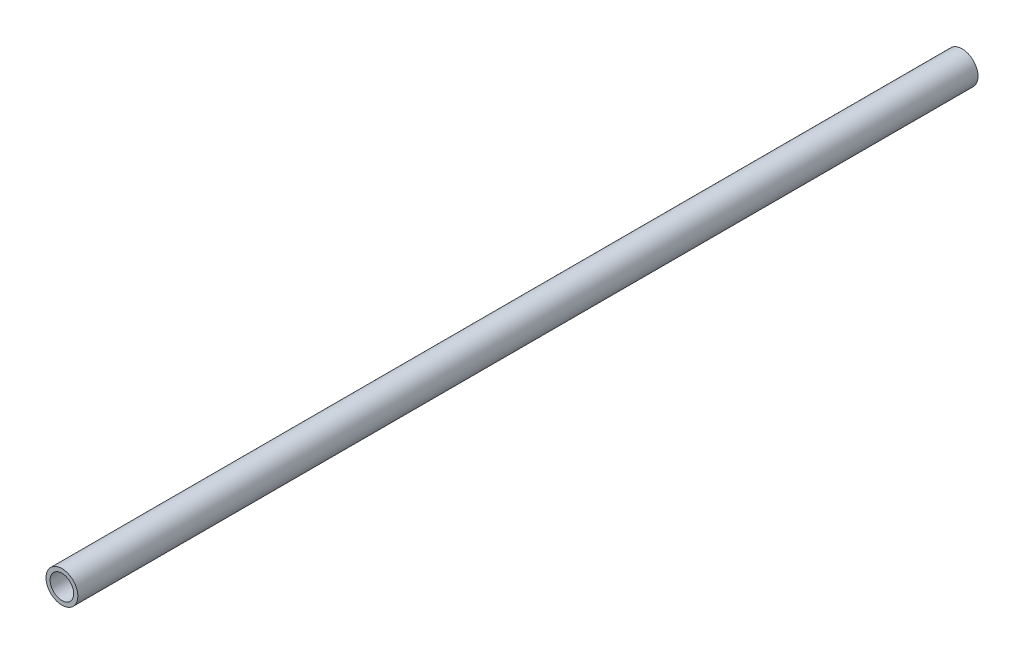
from build123d import *

# Parameters (mm, degrees)
SKETCH1_R           = 10.7696
SKETCH1_R_2         = 8.001
BOSS_EXTRUDE1_DEPTH = 304.8


with BuildPart() as part:
    # Sketch1 → Boss-Extrude1 (new, symmetric)
    with BuildSketch(Plane.XY):
        with Locations(Location((0, 0, 0), (0, 0, 180))):
            Circle(SKETCH1_R)
        with Locations(Location((0, 0, 0), (0, 0, 180))):
            Circle(SKETCH1_R_2, mode=Mode.SUBTRACT)
    extrude(amount=BOSS_EXTRUDE1_DEPTH, both=True)


solid = part.part
